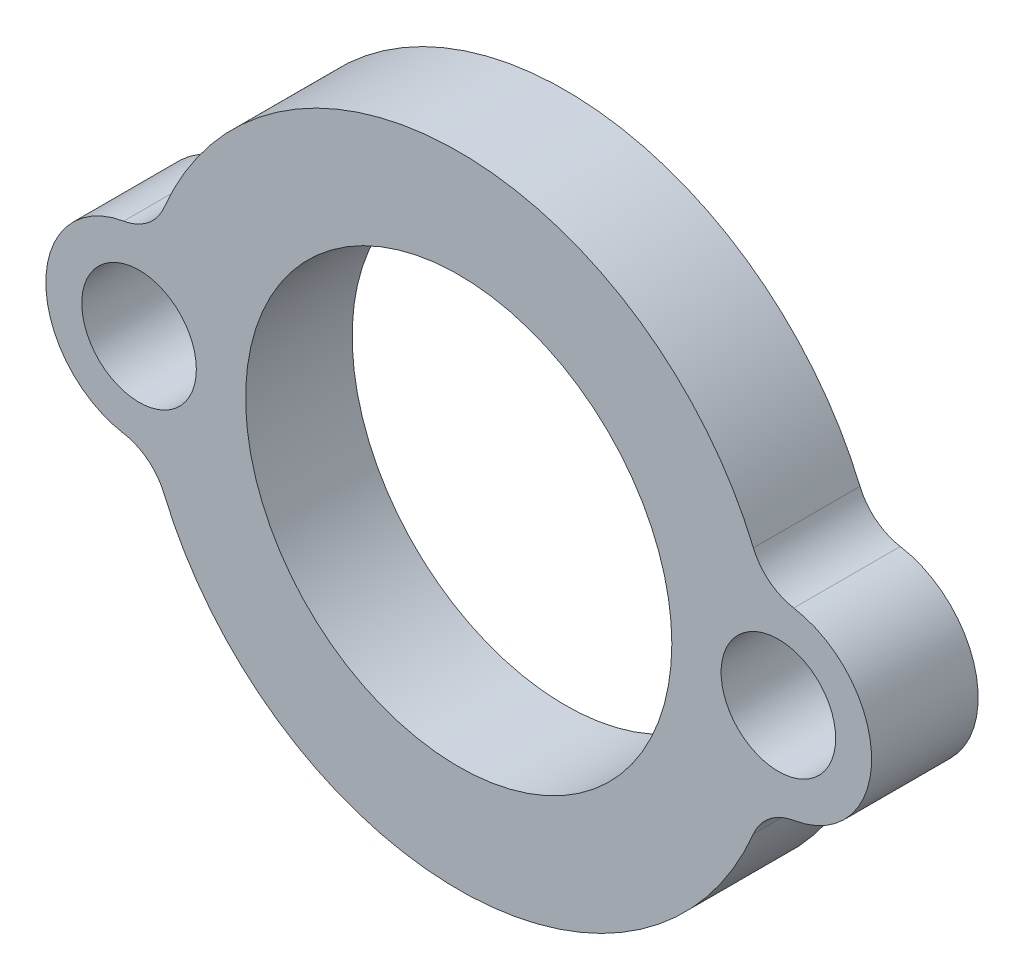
ISO-10303-21;
HEADER;
FILE_DESCRIPTION(('STEP AP214'),'2;1');
FILE_NAME('part.step','',(''),(''),'','','');
FILE_SCHEMA(('AUTOMOTIVE_DESIGN { 1 0 10303 214 1 1 1 1 }'));
ENDSEC;
DATA;
#1=APPLICATION_CONTEXT('core data for automotive mechanical design processes');
#2=APPLICATION_PROTOCOL_DEFINITION('international standard','automotive_design',2000,#1);
#3=PRODUCT_CONTEXT('',#1,'mechanical');
#4=PRODUCT('Part','Part','',(#3));
#5=PRODUCT_RELATED_PRODUCT_CATEGORY('part','',(#4));
#6=PRODUCT_DEFINITION_FORMATION('','',#4);
#7=PRODUCT_DEFINITION_CONTEXT('part definition',#1,'design');
#8=PRODUCT_DEFINITION('design','',#6,#7);
#9=PRODUCT_DEFINITION_SHAPE('','',#8);
#10=(LENGTH_UNIT() NAMED_UNIT(*) SI_UNIT(.MILLI.,.METRE.));
#11=(NAMED_UNIT(*) PLANE_ANGLE_UNIT() SI_UNIT($,.RADIAN.));
#12=(NAMED_UNIT(*) SI_UNIT($,.STERADIAN.) SOLID_ANGLE_UNIT());
#13=UNCERTAINTY_MEASURE_WITH_UNIT(LENGTH_MEASURE(1.E-05),#10,'distance_accuracy_value','');
#14=(GEOMETRIC_REPRESENTATION_CONTEXT(3) GLOBAL_UNCERTAINTY_ASSIGNED_CONTEXT((#13)) GLOBAL_UNIT_ASSIGNED_CONTEXT((#10,
#11,#12)) REPRESENTATION_CONTEXT('',''));
#15=CARTESIAN_POINT('',(0.,0.,0.));
#16=DIRECTION('',(0.,0.,1.));
#17=DIRECTION('',(1.,0.,0.));
#18=AXIS2_PLACEMENT_3D('',#15,#16,#17);
#19=CARTESIAN_POINT('',(-6.,0.,4.));
#20=DIRECTION('',(0.,0.,1.));
#21=DIRECTION('',(1.,0.,0.));
#22=AXIS2_PLACEMENT_3D('',#19,#20,#21);
#23=PLANE('',#22);
#24=CARTESIAN_POINT('',(12.,0.,4.));
#25=DIRECTION('',(0.,0.,1.));
#26=DIRECTION('',(1.,0.,0.));
#27=AXIS2_PLACEMENT_3D('',#24,#25,#26);
#28=CIRCLE('',#27,2.15);
#29=CARTESIAN_POINT('',(14.15,0.,4.));
#30=VERTEX_POINT('',#29);
#31=EDGE_CURVE('E181',#30,#30,#28,.T.);
#32=ORIENTED_EDGE('',*,*,#31,.F.);
#33=EDGE_LOOP('',(#32));
#34=FACE_BOUND('',#33,.T.);
#35=CARTESIAN_POINT('',(12.,0.,4.));
#36=DIRECTION('',(0.,0.,1.));
#37=DIRECTION('',(1.,0.,0.));
#38=AXIS2_PLACEMENT_3D('',#35,#36,#37);
#39=CIRCLE('',#38,3.5);
#40=CARTESIAN_POINT('',(12.5767045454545,-3.45216046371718,4.));
#41=VERTEX_POINT('',#40);
#42=CARTESIAN_POINT('',(12.5767045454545,3.45216046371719,4.));
#43=VERTEX_POINT('',#42);
#44=EDGE_CURVE('E116',#41,#43,#39,.T.);
#45=ORIENTED_EDGE('',*,*,#44,.T.);
#46=CARTESIAN_POINT('',(12.90625,5.4248235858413,4.));
#47=DIRECTION('',(0.,0.,1.));
#48=DIRECTION('',(1.,0.,0.));
#49=AXIS2_PLACEMENT_3D('',#46,#47,#48);
#50=CIRCLE('',#49,2.);
#51=CARTESIAN_POINT('',(11.0625,4.64984878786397,4.));
#52=VERTEX_POINT('',#51);
#53=EDGE_CURVE('E11',#43,#52,#50,.F.);
#54=ORIENTED_EDGE('',*,*,#53,.T.);
#55=CARTESIAN_POINT('',(0.,0.,4.));
#56=DIRECTION('',(0.,0.,1.));
#57=DIRECTION('',(1.,0.,0.));
#58=AXIS2_PLACEMENT_3D('',#55,#56,#57);
#59=CIRCLE('',#58,12.);
#60=CARTESIAN_POINT('',(-11.0625,4.64984878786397,4.));
#61=VERTEX_POINT('',#60);
#62=EDGE_CURVE('E123',#52,#61,#59,.T.);
#63=ORIENTED_EDGE('',*,*,#62,.T.);
#64=CARTESIAN_POINT('',(-12.90625,5.42482358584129,4.));
#65=DIRECTION('',(0.,0.,1.));
#66=DIRECTION('',(1.,0.,0.));
#67=AXIS2_PLACEMENT_3D('',#64,#65,#66);
#68=CIRCLE('',#67,2.);
#69=CARTESIAN_POINT('',(-12.5767045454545,3.45216046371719,4.));
#70=VERTEX_POINT('',#69);
#71=EDGE_CURVE('E152',#61,#70,#68,.F.);
#72=ORIENTED_EDGE('',*,*,#71,.T.);
#73=CARTESIAN_POINT('',(-12.,0.,4.));
#74=DIRECTION('',(0.,0.,1.));
#75=DIRECTION('',(1.,0.,0.));
#76=AXIS2_PLACEMENT_3D('',#73,#74,#75);
#77=CIRCLE('',#76,3.5);
#78=CARTESIAN_POINT('',(-12.5767045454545,-3.45216046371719,4.));
#79=VERTEX_POINT('',#78);
#80=EDGE_CURVE('E126',#70,#79,#77,.T.);
#81=ORIENTED_EDGE('',*,*,#80,.T.);
#82=CARTESIAN_POINT('',(-12.90625,-5.42482358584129,4.));
#83=DIRECTION('',(0.,0.,1.));
#84=DIRECTION('',(1.,0.,0.));
#85=AXIS2_PLACEMENT_3D('',#82,#83,#84);
#86=CIRCLE('',#85,2.);
#87=CARTESIAN_POINT('',(-11.0625,-4.64984878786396,4.));
#88=VERTEX_POINT('',#87);
#89=EDGE_CURVE('E148',#79,#88,#86,.F.);
#90=ORIENTED_EDGE('',*,*,#89,.T.);
#91=CARTESIAN_POINT('',(0.,0.,4.));
#92=DIRECTION('',(0.,0.,1.));
#93=DIRECTION('',(1.,0.,0.));
#94=AXIS2_PLACEMENT_3D('',#91,#92,#93);
#95=CIRCLE('',#94,12.);
#96=CARTESIAN_POINT('',(11.0625,-4.64984878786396,4.));
#97=VERTEX_POINT('',#96);
#98=EDGE_CURVE('E165',#88,#97,#95,.T.);
#99=ORIENTED_EDGE('',*,*,#98,.T.);
#100=CARTESIAN_POINT('',(12.90625,-5.42482358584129,4.));
#101=DIRECTION('',(0.,0.,1.));
#102=DIRECTION('',(1.,0.,0.));
#103=AXIS2_PLACEMENT_3D('',#100,#101,#102);
#104=CIRCLE('',#103,2.);
#105=EDGE_CURVE('E108',#97,#41,#104,.F.);
#106=ORIENTED_EDGE('',*,*,#105,.T.);
#107=EDGE_LOOP('',(#45,#54,#63,#72,#81,#90,#99,#106));
#108=FACE_BOUND('',#107,.T.);
#109=CARTESIAN_POINT('',(0.,0.,4.));
#110=DIRECTION('',(0.,0.,1.));
#111=DIRECTION('',(1.,0.,0.));
#112=AXIS2_PLACEMENT_3D('',#109,#110,#111);
#113=CIRCLE('',#112,8.);
#114=CARTESIAN_POINT('',(8.,0.,4.));
#115=VERTEX_POINT('',#114);
#116=EDGE_CURVE('E171',#115,#115,#113,.T.);
#117=ORIENTED_EDGE('',*,*,#116,.F.);
#118=EDGE_LOOP('',(#117));
#119=FACE_BOUND('',#118,.T.);
#120=CARTESIAN_POINT('',(-12.,0.,4.));
#121=DIRECTION('',(0.,0.,1.));
#122=DIRECTION('',(1.,0.,0.));
#123=AXIS2_PLACEMENT_3D('',#120,#121,#122);
#124=CIRCLE('',#123,2.15);
#125=CARTESIAN_POINT('',(-9.85,0.,4.));
#126=VERTEX_POINT('',#125);
#127=EDGE_CURVE('E186',#126,#126,#124,.T.);
#128=ORIENTED_EDGE('',*,*,#127,.F.);
#129=EDGE_LOOP('',(#128));
#130=FACE_BOUND('',#129,.T.);
#131=ADVANCED_FACE('F33',(#34,#108,#119,#130),#23,.T.);
#132=CARTESIAN_POINT('',(-6.,0.,0.));
#133=DIRECTION('',(0.,0.,1.));
#134=DIRECTION('',(1.,0.,0.));
#135=AXIS2_PLACEMENT_3D('',#132,#133,#134);
#136=PLANE('',#135);
#137=CARTESIAN_POINT('',(0.,0.,0.));
#138=DIRECTION('',(0.,0.,1.));
#139=DIRECTION('',(1.,0.,0.));
#140=AXIS2_PLACEMENT_3D('',#137,#138,#139);
#141=CIRCLE('',#140,12.);
#142=CARTESIAN_POINT('',(11.0625,4.64984878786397,0.));
#143=VERTEX_POINT('',#142);
#144=CARTESIAN_POINT('',(-11.0625,4.64984878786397,0.));
#145=VERTEX_POINT('',#144);
#146=EDGE_CURVE('E168',#143,#145,#141,.T.);
#147=ORIENTED_EDGE('',*,*,#146,.F.);
#148=CARTESIAN_POINT('',(12.90625,5.4248235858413,0.));
#149=DIRECTION('',(0.,0.,1.));
#150=DIRECTION('',(1.,0.,0.));
#151=AXIS2_PLACEMENT_3D('',#148,#149,#150);
#152=CIRCLE('',#151,2.);
#153=CARTESIAN_POINT('',(12.5767045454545,3.45216046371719,0.));
#154=VERTEX_POINT('',#153);
#155=EDGE_CURVE('E41',#143,#154,#152,.T.);
#156=ORIENTED_EDGE('',*,*,#155,.T.);
#157=CARTESIAN_POINT('',(12.,0.,0.));
#158=DIRECTION('',(0.,0.,1.));
#159=DIRECTION('',(1.,0.,0.));
#160=AXIS2_PLACEMENT_3D('',#157,#158,#159);
#161=CIRCLE('',#160,3.5);
#162=CARTESIAN_POINT('',(12.5767045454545,-3.45216046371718,0.));
#163=VERTEX_POINT('',#162);
#164=EDGE_CURVE('E114',#163,#154,#161,.T.);
#165=ORIENTED_EDGE('',*,*,#164,.F.);
#166=CARTESIAN_POINT('',(12.90625,-5.42482358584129,0.));
#167=DIRECTION('',(0.,0.,1.));
#168=DIRECTION('',(1.,0.,0.));
#169=AXIS2_PLACEMENT_3D('',#166,#167,#168);
#170=CIRCLE('',#169,2.);
#171=CARTESIAN_POINT('',(11.0625,-4.64984878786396,0.));
#172=VERTEX_POINT('',#171);
#173=EDGE_CURVE('E98',#163,#172,#170,.T.);
#174=ORIENTED_EDGE('',*,*,#173,.T.);
#175=CARTESIAN_POINT('',(0.,0.,0.));
#176=DIRECTION('',(0.,0.,1.));
#177=DIRECTION('',(1.,0.,0.));
#178=AXIS2_PLACEMENT_3D('',#175,#176,#177);
#179=CIRCLE('',#178,12.);
#180=CARTESIAN_POINT('',(-11.0625,-4.64984878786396,0.));
#181=VERTEX_POINT('',#180);
#182=EDGE_CURVE('E124',#181,#172,#179,.T.);
#183=ORIENTED_EDGE('',*,*,#182,.F.);
#184=CARTESIAN_POINT('',(-12.90625,-5.42482358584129,0.));
#185=DIRECTION('',(0.,0.,1.));
#186=DIRECTION('',(1.,0.,0.));
#187=AXIS2_PLACEMENT_3D('',#184,#185,#186);
#188=CIRCLE('',#187,2.);
#189=CARTESIAN_POINT('',(-12.5767045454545,-3.45216046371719,0.));
#190=VERTEX_POINT('',#189);
#191=EDGE_CURVE('E146',#181,#190,#188,.T.);
#192=ORIENTED_EDGE('',*,*,#191,.T.);
#193=CARTESIAN_POINT('',(-12.,0.,0.));
#194=DIRECTION('',(0.,0.,1.));
#195=DIRECTION('',(1.,0.,0.));
#196=AXIS2_PLACEMENT_3D('',#193,#194,#195);
#197=CIRCLE('',#196,3.5);
#198=CARTESIAN_POINT('',(-12.5767045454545,3.45216046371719,0.));
#199=VERTEX_POINT('',#198);
#200=EDGE_CURVE('E128',#199,#190,#197,.T.);
#201=ORIENTED_EDGE('',*,*,#200,.F.);
#202=CARTESIAN_POINT('',(-12.90625,5.42482358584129,0.));
#203=DIRECTION('',(0.,0.,1.));
#204=DIRECTION('',(1.,0.,0.));
#205=AXIS2_PLACEMENT_3D('',#202,#203,#204);
#206=CIRCLE('',#205,2.);
#207=EDGE_CURVE('E150',#199,#145,#206,.T.);
#208=ORIENTED_EDGE('',*,*,#207,.T.);
#209=EDGE_LOOP('',(#147,#156,#165,#174,#183,#192,#201,#208));
#210=FACE_BOUND('',#209,.T.);
#211=CARTESIAN_POINT('',(0.,0.,0.));
#212=DIRECTION('',(0.,0.,1.));
#213=DIRECTION('',(1.,0.,0.));
#214=AXIS2_PLACEMENT_3D('',#211,#212,#213);
#215=CIRCLE('',#214,8.);
#216=CARTESIAN_POINT('',(8.,0.,0.));
#217=VERTEX_POINT('',#216);
#218=EDGE_CURVE('E174',#217,#217,#215,.T.);
#219=ORIENTED_EDGE('',*,*,#218,.T.);
#220=EDGE_LOOP('',(#219));
#221=FACE_BOUND('',#220,.T.);
#222=CARTESIAN_POINT('',(12.,0.,0.));
#223=DIRECTION('',(0.,0.,1.));
#224=DIRECTION('',(1.,0.,0.));
#225=AXIS2_PLACEMENT_3D('',#222,#223,#224);
#226=CIRCLE('',#225,2.15);
#227=CARTESIAN_POINT('',(14.15,0.,0.));
#228=VERTEX_POINT('',#227);
#229=EDGE_CURVE('E183',#228,#228,#226,.T.);
#230=ORIENTED_EDGE('',*,*,#229,.T.);
#231=EDGE_LOOP('',(#230));
#232=FACE_BOUND('',#231,.T.);
#233=CARTESIAN_POINT('',(-12.,0.,0.));
#234=DIRECTION('',(0.,0.,1.));
#235=DIRECTION('',(1.,0.,0.));
#236=AXIS2_PLACEMENT_3D('',#233,#234,#235);
#237=CIRCLE('',#236,2.15);
#238=CARTESIAN_POINT('',(-9.85,0.,0.));
#239=VERTEX_POINT('',#238);
#240=EDGE_CURVE('E189',#239,#239,#237,.T.);
#241=ORIENTED_EDGE('',*,*,#240,.T.);
#242=EDGE_LOOP('',(#241));
#243=FACE_BOUND('',#242,.T.);
#244=ADVANCED_FACE('F121',(#210,#221,#232,#243),#136,.F.);
#245=CARTESIAN_POINT('',(0.,0.,4.));
#246=DIRECTION('',(0.,0.,-1.));
#247=DIRECTION('',(-1.,0.,0.));
#248=AXIS2_PLACEMENT_3D('',#245,#246,#247);
#249=CYLINDRICAL_SURFACE('',#248,12.);
#250=ORIENTED_EDGE('',*,*,#146,.T.);
#251=DIRECTION('',(0.,0.,-1.));
#252=VECTOR('',#251,1.);
#253=CARTESIAN_POINT('',(-11.0625,4.64984878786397,4.));
#254=LINE('',#253,#252);
#255=EDGE_CURVE('E48',#145,#61,#254,.F.);
#256=ORIENTED_EDGE('',*,*,#255,.T.);
#257=ORIENTED_EDGE('',*,*,#62,.F.);
#258=DIRECTION('',(0.,0.,-1.));
#259=VECTOR('',#258,1.);
#260=CARTESIAN_POINT('',(11.0625,4.64984878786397,4.));
#261=LINE('',#260,#259);
#262=EDGE_CURVE('E141',#52,#143,#261,.T.);
#263=ORIENTED_EDGE('',*,*,#262,.T.);
#264=EDGE_LOOP('',(#250,#256,#257,#263));
#265=FACE_BOUND('',#264,.T.);
#266=ADVANCED_FACE('F169',(#265),#249,.T.);
#267=CARTESIAN_POINT('',(-12.,0.,4.));
#268=DIRECTION('',(0.,0.,-1.));
#269=DIRECTION('',(-1.,0.,0.));
#270=AXIS2_PLACEMENT_3D('',#267,#268,#269);
#271=CYLINDRICAL_SURFACE('',#270,3.5);
#272=ORIENTED_EDGE('',*,*,#200,.T.);
#273=DIRECTION('',(0.,0.,-1.));
#274=VECTOR('',#273,1.);
#275=CARTESIAN_POINT('',(-12.5767045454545,-3.45216046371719,4.));
#276=LINE('',#275,#274);
#277=EDGE_CURVE('E139',#190,#79,#276,.F.);
#278=ORIENTED_EDGE('',*,*,#277,.T.);
#279=ORIENTED_EDGE('',*,*,#80,.F.);
#280=DIRECTION('',(0.,0.,-1.));
#281=VECTOR('',#280,1.);
#282=CARTESIAN_POINT('',(-12.5767045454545,3.45216046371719,4.));
#283=LINE('',#282,#281);
#284=EDGE_CURVE('E136',#70,#199,#283,.T.);
#285=ORIENTED_EDGE('',*,*,#284,.T.);
#286=EDGE_LOOP('',(#272,#278,#279,#285));
#287=FACE_BOUND('',#286,.T.);
#288=ADVANCED_FACE('F162',(#287),#271,.T.);
#289=CARTESIAN_POINT('',(0.,0.,4.));
#290=DIRECTION('',(0.,0.,-1.));
#291=DIRECTION('',(-1.,0.,0.));
#292=AXIS2_PLACEMENT_3D('',#289,#290,#291);
#293=CYLINDRICAL_SURFACE('',#292,12.);
#294=ORIENTED_EDGE('',*,*,#182,.T.);
#295=DIRECTION('',(0.,0.,-1.));
#296=VECTOR('',#295,1.);
#297=CARTESIAN_POINT('',(11.0625,-4.64984878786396,4.));
#298=LINE('',#297,#296);
#299=EDGE_CURVE('E103',#172,#97,#298,.F.);
#300=ORIENTED_EDGE('',*,*,#299,.T.);
#301=ORIENTED_EDGE('',*,*,#98,.F.);
#302=DIRECTION('',(0.,0.,-1.));
#303=VECTOR('',#302,1.);
#304=CARTESIAN_POINT('',(-11.0625,-4.64984878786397,4.));
#305=LINE('',#304,#303);
#306=EDGE_CURVE('E117',#88,#181,#305,.T.);
#307=ORIENTED_EDGE('',*,*,#306,.T.);
#308=EDGE_LOOP('',(#294,#300,#301,#307));
#309=FACE_BOUND('',#308,.T.);
#310=ADVANCED_FACE('F212',(#309),#293,.T.);
#311=CARTESIAN_POINT('',(12.,0.,4.));
#312=DIRECTION('',(0.,0.,-1.));
#313=DIRECTION('',(-1.,0.,0.));
#314=AXIS2_PLACEMENT_3D('',#311,#312,#313);
#315=CYLINDRICAL_SURFACE('',#314,3.5);
#316=ORIENTED_EDGE('',*,*,#44,.F.);
#317=DIRECTION('',(0.,0.,-1.));
#318=VECTOR('',#317,1.);
#319=CARTESIAN_POINT('',(12.5767045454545,-3.45216046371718,4.));
#320=LINE('',#319,#318);
#321=EDGE_CURVE('E102',#41,#163,#320,.T.);
#322=ORIENTED_EDGE('',*,*,#321,.T.);
#323=ORIENTED_EDGE('',*,*,#164,.T.);
#324=DIRECTION('',(0.,0.,-1.));
#325=VECTOR('',#324,1.);
#326=CARTESIAN_POINT('',(12.5767045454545,3.45216046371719,4.));
#327=LINE('',#326,#325);
#328=EDGE_CURVE('E118',#154,#43,#327,.F.);
#329=ORIENTED_EDGE('',*,*,#328,.T.);
#330=EDGE_LOOP('',(#316,#322,#323,#329));
#331=FACE_BOUND('',#330,.T.);
#332=ADVANCED_FACE('F113',(#331),#315,.T.);
#333=CARTESIAN_POINT('',(0.,0.,4.));
#334=DIRECTION('',(0.,0.,-1.));
#335=DIRECTION('',(-1.,0.,0.));
#336=AXIS2_PLACEMENT_3D('',#333,#334,#335);
#337=CYLINDRICAL_SURFACE('',#336,8.);
#338=ORIENTED_EDGE('',*,*,#116,.T.);
#339=EDGE_LOOP('',(#338));
#340=FACE_BOUND('',#339,.T.);
#341=ORIENTED_EDGE('',*,*,#218,.F.);
#342=EDGE_LOOP('',(#341));
#343=FACE_BOUND('',#342,.T.);
#344=ADVANCED_FACE('F207',(#340,#343),#337,.F.);
#345=CARTESIAN_POINT('',(12.,0.,4.));
#346=DIRECTION('',(0.,0.,-1.));
#347=DIRECTION('',(-1.,0.,0.));
#348=AXIS2_PLACEMENT_3D('',#345,#346,#347);
#349=CYLINDRICAL_SURFACE('',#348,2.15);
#350=ORIENTED_EDGE('',*,*,#31,.T.);
#351=EDGE_LOOP('',(#350));
#352=FACE_BOUND('',#351,.T.);
#353=ORIENTED_EDGE('',*,*,#229,.F.);
#354=EDGE_LOOP('',(#353));
#355=FACE_BOUND('',#354,.T.);
#356=ADVANCED_FACE('F295',(#352,#355),#349,.F.);
#357=CARTESIAN_POINT('',(-12.,0.,4.));
#358=DIRECTION('',(0.,0.,-1.));
#359=DIRECTION('',(-1.,0.,0.));
#360=AXIS2_PLACEMENT_3D('',#357,#358,#359);
#361=CYLINDRICAL_SURFACE('',#360,2.15);
#362=ORIENTED_EDGE('',*,*,#127,.T.);
#363=EDGE_LOOP('',(#362));
#364=FACE_BOUND('',#363,.T.);
#365=ORIENTED_EDGE('',*,*,#240,.F.);
#366=EDGE_LOOP('',(#365));
#367=FACE_BOUND('',#366,.T.);
#368=ADVANCED_FACE('F195',(#364,#367),#361,.F.);
#369=CARTESIAN_POINT('',(12.90625,-5.42482358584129,4.));
#370=DIRECTION('',(0.,0.,1.));
#371=DIRECTION('',(1.,0.,0.));
#372=AXIS2_PLACEMENT_3D('',#369,#370,#371);
#373=CYLINDRICAL_SURFACE('',#372,2.);
#374=ORIENTED_EDGE('',*,*,#105,.F.);
#375=ORIENTED_EDGE('',*,*,#299,.F.);
#376=ORIENTED_EDGE('',*,*,#173,.F.);
#377=ORIENTED_EDGE('',*,*,#321,.F.);
#378=EDGE_LOOP('',(#374,#375,#376,#377));
#379=FACE_BOUND('',#378,.T.);
#380=ADVANCED_FACE('F101',(#379),#373,.F.);
#381=CARTESIAN_POINT('',(-12.90625,-5.42482358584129,4.));
#382=DIRECTION('',(0.,0.,1.));
#383=DIRECTION('',(1.,0.,0.));
#384=AXIS2_PLACEMENT_3D('',#381,#382,#383);
#385=CYLINDRICAL_SURFACE('',#384,2.);
#386=ORIENTED_EDGE('',*,*,#89,.F.);
#387=ORIENTED_EDGE('',*,*,#277,.F.);
#388=ORIENTED_EDGE('',*,*,#191,.F.);
#389=ORIENTED_EDGE('',*,*,#306,.F.);
#390=EDGE_LOOP('',(#386,#387,#388,#389));
#391=FACE_BOUND('',#390,.T.);
#392=ADVANCED_FACE('F222',(#391),#385,.F.);
#393=CARTESIAN_POINT('',(-12.90625,5.42482358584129,4.));
#394=DIRECTION('',(0.,0.,1.));
#395=DIRECTION('',(1.,0.,0.));
#396=AXIS2_PLACEMENT_3D('',#393,#394,#395);
#397=CYLINDRICAL_SURFACE('',#396,2.);
#398=ORIENTED_EDGE('',*,*,#71,.F.);
#399=ORIENTED_EDGE('',*,*,#255,.F.);
#400=ORIENTED_EDGE('',*,*,#207,.F.);
#401=ORIENTED_EDGE('',*,*,#284,.F.);
#402=EDGE_LOOP('',(#398,#399,#400,#401));
#403=FACE_BOUND('',#402,.T.);
#404=ADVANCED_FACE('F167',(#403),#397,.F.);
#405=CARTESIAN_POINT('',(12.90625,5.4248235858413,4.));
#406=DIRECTION('',(0.,0.,1.));
#407=DIRECTION('',(1.,0.,0.));
#408=AXIS2_PLACEMENT_3D('',#405,#406,#407);
#409=CYLINDRICAL_SURFACE('',#408,2.);
#410=ORIENTED_EDGE('',*,*,#53,.F.);
#411=ORIENTED_EDGE('',*,*,#328,.F.);
#412=ORIENTED_EDGE('',*,*,#155,.F.);
#413=ORIENTED_EDGE('',*,*,#262,.F.);
#414=EDGE_LOOP('',(#410,#411,#412,#413));
#415=FACE_BOUND('',#414,.T.);
#416=ADVANCED_FACE('F35',(#415),#409,.F.);
#417=CLOSED_SHELL('',(#131,#244,#266,#288,#310,#332,#344,#356,#368,#380,#392,#404,#416));
#418=MANIFOLD_SOLID_BREP('B2',#417);
#419=ADVANCED_BREP_SHAPE_REPRESENTATION('',(#18,#418),#14);
#420=SHAPE_DEFINITION_REPRESENTATION(#9,#419);
ENDSEC;
END-ISO-10303-21;
